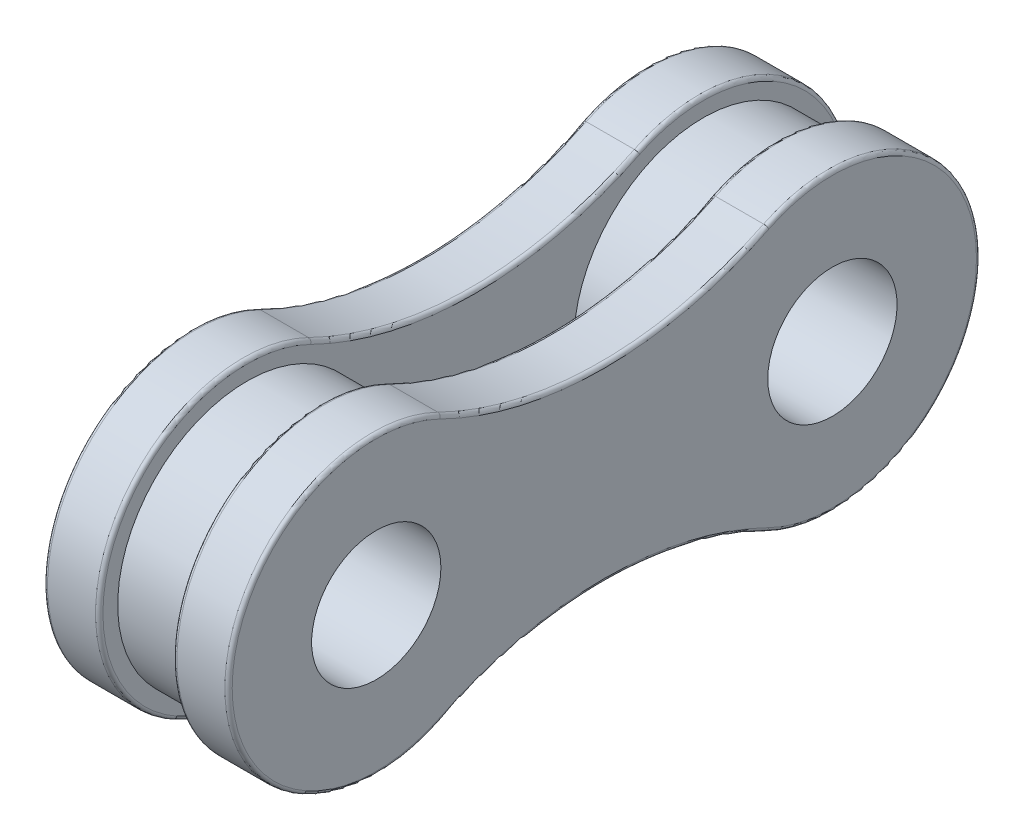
from build123d import *

# Parameters (mm, degrees)
BOSS_EXTRUDE1_START = 1
SKETCH1_R           = 1.75
BOSS_EXTRUDE1_DEPTH = 1.5
BOSS_EXTRUDE2_START = -1
SKETCH2_R           = 1.75
BOSS_EXTRUDE2_DEPTH = 1.5
SKETCH3_R           = 3.5
SKETCH3_R_2         = 1.75
BOSS_EXTRUDE3_DEPTH = 1
FILLET1_R           = 0.1


with BuildPart() as part:
    # Sketch1 → Boss-Extrude1 (new body)
    with BuildSketch(Plane(origin=(0, 0, 0), x_dir=(0, 0, -1), z_dir=(1, 0, 0)).offset(BOSS_EXTRUDE1_START)):
        with BuildLine():
            ThreePointArc((-4.410714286, 3.589888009), (-10.175, 0), (-4.410714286, -3.589888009))
            ThreePointArc((-4.410714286, -3.589888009), (0, -2.564608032), (4.410714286, -3.589888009))
            ThreePointArc((4.410714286, -3.589888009), (10.175, 0), (4.410714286, 3.589888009))
            ThreePointArc((4.410714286, 3.589888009), (0, 2.564608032), (-4.410714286, 3.589888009))
        make_face()
        with Locations((-6.175, 0)):
            Circle(SKETCH1_R, mode=Mode.SUBTRACT)
        with Locations(Location((6.175, 0, 0), (0, 0, 180))):
            Circle(SKETCH1_R, mode=Mode.SUBTRACT)
    extrude(amount=BOSS_EXTRUDE1_DEPTH)



with BuildPart() as body_2:
    # Sketch2 → Boss-Extrude2 (new body)
    with BuildSketch(Plane(origin=(0, 0, 0), x_dir=(0, 0, -1), z_dir=(1, 0, 0)).offset(BOSS_EXTRUDE2_START)):
        with BuildLine():
            ThreePointArc((4.410714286, -3.589888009), (0, -2.564608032), (-4.410714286, -3.589888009))
            ThreePointArc((-4.410714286, -3.589888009), (-10.175, 0), (-4.410714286, 3.589888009))
            ThreePointArc((-4.410714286, 3.589888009), (0, 2.564608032), (4.410714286, 3.589888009))
            ThreePointArc((4.410714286, 3.589888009), (10.175, 0), (4.410714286, -3.589888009))
        make_face()
        with Locations(Location((6.175, 0, 0), (0, 0, 180))):
            Circle(SKETCH2_R, mode=Mode.SUBTRACT)
        with Locations((-6.175, 0)):
            Circle(SKETCH2_R, mode=Mode.SUBTRACT)
    extrude(amount=-BOSS_EXTRUDE2_DEPTH)


with BuildPart() as part_1:
    add(part.part)

    add(body_2.part)  # Boss-Extrude3 merges body 2
    # Sketch3 → Boss-Extrude3 (add, symmetric)
    # profile 1 of 2: a face of its own
    with BuildSketch(Plane(origin=(0, 0, 0), x_dir=(0, 0, -1), z_dir=(1, 0, 0))):
        with Locations((-6.175, 0)):
            Circle(SKETCH3_R)
        with Locations((-6.175, 0)):
            Circle(SKETCH3_R_2, mode=Mode.SUBTRACT)
    # profile 2 of 2: a face of its own
    with BuildSketch(Plane(origin=(0, 0, 0), x_dir=(0, 0, -1), z_dir=(1, 0, 0))):
        with Locations((6.175, 0)):
            Circle(SKETCH3_R)
        with Locations(Location((6.175, 0, 0), (0, 0, 180))):
            Circle(SKETCH3_R_2, mode=Mode.SUBTRACT)
    extrude(amount=BOSS_EXTRUDE3_DEPTH, both=True)

    # Fillet1
    fillet1_edges = [part_1.edges().sort_by_distance(p)[0] for p in [
        (2.5, -2.564608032, 0),
        (2.5, 0, -10.175),
        (-2.5, 0, -10.175),
        (-2.5, -2.564608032, 0),
        (-2.5, 0, 10.175),
        (-2.5, 2.564608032, 0),
        (-1, 0, -10.175),
        (-1, 2.564608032, 0),
        (-1, 0, 10.175),
        (-1, -2.564608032, 0),
        (2.5, 2.564608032, 0),
        (1, 0, -10.175),
        (1, -2.564608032, 0),
        (1, 0, 10.175),
        (1, 2.564608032, 0),
        (2.5, 0, 10.175),
    ]]
    fillet(fillet1_edges, radius=FILLET1_R)


solid = part_1.part
